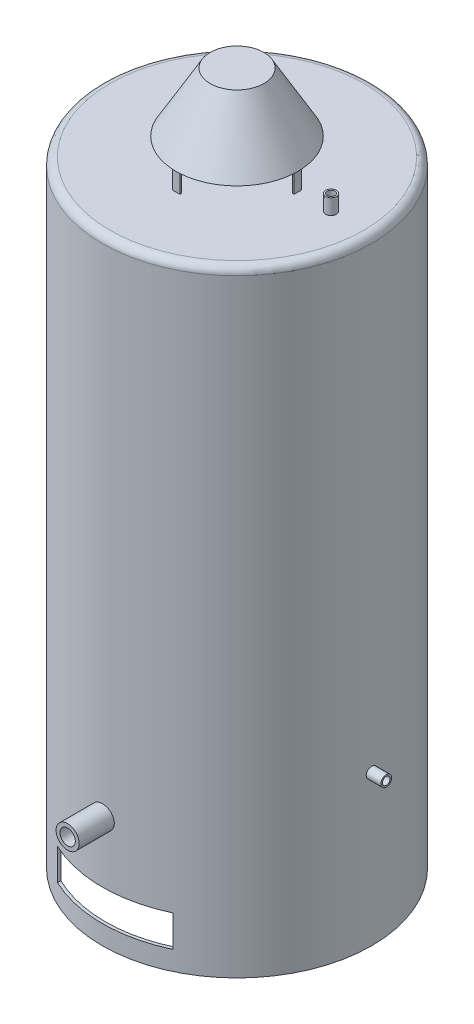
from build123d import *

# Parameters (mm, degrees)
SKETCH1_W               = 35
SKETCH1_H               = 4
SKETCH1_W_2             = 2.309401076
SKETCH1_H_2             = 23.341865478
SKETCH1_W_3             = 132
SKETCH1_H_3             = 700.940720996
SKETCH1_W_4             = 4
SKETCH1_H_4             = 20
CUT_EXTRUDE1_DEPTH      = 637.247074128
CUT_EXTRUDE1_DEPTH_BACK = 637.247074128
SKETCH2_W               = 50
SKETCH2_H               = 23.341865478
CUT_EXTRUDE2_DEPTH      = 637.247074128
CUT_EXTRUDE2_DEPTH_BACK = 637.247074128
SKETCH3_W               = 61.22677782
SKETCH3_H               = 23.341865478
SKETCH4_R               = 39
SKETCH4_R_2             = 35
BOSS_EXTRUDE1_DEPTH     = 20
FILLET3_R               = 10
FILLET4_R               = 10
CUT_EXTRUDE5_DEPTH      = 637.247074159
CUT_EXTRUDE5_DEPTH_BACK = 637.247074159
SKETCH5_W               = 75
SKETCH5_H               = 40.96262001
CUT_EXTRUDE6_REACH      = 638.247
CUT_EXTRUDE6_END_RADIUS = 175
SKETCH6_R               = 10
SKETCH7_R               = 7
SKETCH7_R_2             = 5
BOSS_EXTRUDE2_DEPTH     = 20
BOSS_EXTRUDE3_START     = 140
SKETCH8_R               = 7
SKETCH8_R_2             = 5
BOSS_EXTRUDE3_DEPTH     = 30
BOSS_EXTRUDE4_START     = 140
SKETCH9_R               = 15
SKETCH9_R_2             = 10
BOSS_EXTRUDE4_DEPTH     = 80
CUT_EXTRUDE8_REACH      = 855.111
SKETCH10_R              = 5
CUT_EXTRUDE10_START     = 110
SKETCH11_R              = 5
CUT_EXTRUDE10_DEPTH     = 541.065642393
CUT_EXTRUDE11_START     = 120
SKETCH12_R              = 10
CUT_EXTRUDE11_DEPTH     = 531.065642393


with BuildPart() as part:
    # Sketch1 → Revolve2 (revolve)
    with BuildSketch(Plane.XY, mode=Mode.PRIVATE) as revolve2_sk:
        with Locations((-6.37755102, 576.474769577)):
            Rectangle(SKETCH1_W, SKETCH1_H)
        Polygon((53.071642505, 501.816635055), (11.12244898, 574.474769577), (11.12244898, 578.474769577), (55.381043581, 501.816635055), align=None)
        with Locations((54.226343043, 490.145702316)):
            Rectangle(SKETCH1_W_2, SKETCH1_H_2)
        Polygon((147.12244898, -230.465951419), (147.12244898, -321.428571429), (151.12244898, -321.428571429), (151.12244898, 478.474769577), (11.12244898, 478.474769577), (11.12244898, -230.465951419), align=None)
        with Locations((81.12244898, 124.004409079)):
            Rectangle(SKETCH1_W_3, SKETCH1_H_3, mode=Mode.SUBTRACT)
        with Locations((13.12244898, 488.474769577)):
            Rectangle(SKETCH1_W_4, SKETCH1_H_4)
    revolve(revolve2_sk.sketch.rotate(Axis((-23.87755102, 578.474769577, 0), (0, -1, 0)), 180), axis=Axis((-23.87755102, 578.474769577, 0), (0, -1, 0)))

    # Sketch2 → Cut-Extrude1 (cut, two sides: drawn at the far end of the back side and taken through both)
    with BuildSketch(Plane.XY.offset(-CUT_EXTRUDE1_DEPTH_BACK)):
        with Locations((-53.87755102, 490.145702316)):
            Rectangle(SKETCH2_W, SKETCH2_H)
        with Locations((6.12244898, 490.145702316)):
            Rectangle(SKETCH2_W, SKETCH2_H)
    extrude(amount=CUT_EXTRUDE1_DEPTH + CUT_EXTRUDE1_DEPTH_BACK, mode=Mode.SUBTRACT)

    # Sketch3 → Cut-Extrude2 (cut, two sides: drawn at the far end of the back side and taken through both)
    with BuildSketch(Plane(origin=(0, 0, 0), x_dir=(0, 0, -1), z_dir=(1, 0, 0)).offset(-CUT_EXTRUDE2_DEPTH_BACK)):
        with Locations((-35.61338891, 490.145702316)):
            Rectangle(SKETCH3_W, SKETCH3_H)
        with Locations((35.61338891, 490.145702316)):
            Rectangle(SKETCH3_W, SKETCH3_H)
    extrude(amount=CUT_EXTRUDE2_DEPTH + CUT_EXTRUDE2_DEPTH_BACK, mode=Mode.SUBTRACT)

    # Sketch4 → Boss-Extrude1 (add)
    with BuildSketch(Plane(origin=(0, 478.474769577, 0), x_dir=(1, 0, 0), z_dir=(0, 1, 0))):
        with Locations(Location((-23.87755102, 0, 0), (0, 0, 180))):
            Circle(SKETCH4_R)
        with Locations(Location((-23.87755102, 0, 0), (0, 0, 180))):
            Circle(SKETCH4_R_2, mode=Mode.SUBTRACT)
    extrude(amount=BOSS_EXTRUDE1_DEPTH)

    # Fillet3
    fillet3_edges = [part.edges().sort_by_distance(p)[0] for p in [
        (151.12244898, 478.474769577, 0),
    ]]
    fillet(fillet3_edges, radius=FILLET3_R)

    # Fillet4
    fillet4_edges = [part.edges().sort_by_distance(p)[0] for p in [
        (147.12244898, 474.474769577, 0),
    ]]
    fillet(fillet4_edges, radius=FILLET4_R)

    # Sketch5 → Cut-Extrude5 (cut, two sides: drawn at the far end of the back side and taken through both)
    with BuildSketch(Plane.XY.offset(-CUT_EXTRUDE5_DEPTH_BACK)):
        with Locations((-61.37755102, -275.947261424)):
            Rectangle(SKETCH5_W, SKETCH5_H)
        with Locations((13.62244898, -275.947261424)):
            Rectangle(SKETCH5_W, SKETCH5_H)
    extrude(amount=CUT_EXTRUDE5_DEPTH + CUT_EXTRUDE5_DEPTH_BACK, mode=Mode.SUBTRACT)

    # Cut-Extrude6: up to this cylinder (the profile starts inside it)
    cut_extrude6_end = Plane(origin=(-23.87755102, -275.947261, 0), z_dir=(0, 1, 0)) * Cylinder(CUT_EXTRUDE6_END_RADIUS, 1627.494, mode=Mode.PRIVATE)
    # Sketch6 → Cut-Extrude6 (cut, up to the surface)
    with BuildSketch(Plane(origin=(0, 0, 0), x_dir=(0, 0, -1), z_dir=(1, 0, 0)), mode=Mode.PRIVATE) as cut_extrude6_sk1:
        with Locations((0, -275.947261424)):
            Circle(SKETCH6_R)
    cut_extrude6_tool1 = extrude(cut_extrude6_sk1.sketch, amount=-CUT_EXTRUDE6_REACH, mode=Mode.PRIVATE) & cut_extrude6_end
    add(cut_extrude6_tool1.solids().sort_by_distance((0, -275.947261, 0))[0], mode=Mode.SUBTRACT)

    # Sketch7 → Boss-Extrude2 (add)
    with BuildSketch(Plane(origin=(0, 478.474769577, 0), x_dir=(1, 0, 0), z_dir=(0, 1, 0))):
        with Locations(Location((98.251746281, 0, 0), (0, 0, 180))):
            Circle(SKETCH7_R)
        with Locations(Location((98.251746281, 0, 0), (0, 0, 180))):
            Circle(SKETCH7_R_2, mode=Mode.SUBTRACT)
    extrude(amount=BOSS_EXTRUDE2_DEPTH)

    # Sketch8 → Boss-Extrude3 (add)
    with BuildSketch(Plane(origin=(0, 0, 0), x_dir=(0, 0, -1), z_dir=(1, 0, 0)).offset(BOSS_EXTRUDE3_START)):
        with Locations(Location((0, -126.465951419, 0), (0, 0, 180))):
            Circle(SKETCH8_R)
        with Locations(Location((0, -126.465951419, 0), (0, 0, 180))):
            Circle(SKETCH8_R_2, mode=Mode.SUBTRACT)
    extrude(amount=BOSS_EXTRUDE3_DEPTH)

    # Sketch9 → Boss-Extrude4 (add)
    with BuildSketch(Plane.XY.offset(BOSS_EXTRUDE4_START)):
        with Locations(Location((-23.87755102, -176.465951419, 0), (0, 0, 180))):
            Circle(SKETCH9_R)
        with Locations(Location((-23.87755102, -176.465951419, 0), (0, 0, 180))):
            Circle(SKETCH9_R_2, mode=Mode.SUBTRACT)
    extrude(amount=BOSS_EXTRUDE4_DEPTH)

    # Sketch10 → Cut-Extrude8 (cut, up to next)
    with BuildSketch(Plane(origin=(0, 478.474769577, 0), x_dir=(1, 0, 0), z_dir=(0, 1, 0)), mode=Mode.PRIVATE) as cut_extrude8_sk1:
        with Locations(Location((98.251746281, 0, 0), (0, 0, 180))):
            Circle(SKETCH10_R)
    cut_extrude8_tool1 = extrude(cut_extrude8_sk1.sketch, amount=-CUT_EXTRUDE8_REACH, mode=Mode.PRIVATE) & part.part
    add(cut_extrude8_tool1.solids().sort_by_distance((98.251746, 478.47477, 0))[0], mode=Mode.SUBTRACT)

    # Sketch11 → Cut-Extrude10 (cut, through all)
    with BuildSketch(Plane(origin=(0, 0, 0), x_dir=(0, 0, -1), z_dir=(1, 0, 0)).offset(CUT_EXTRUDE10_START)):
        with Locations((0, -126.465951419)):
            Circle(SKETCH11_R)
    extrude(amount=CUT_EXTRUDE10_DEPTH, mode=Mode.SUBTRACT)

    # Sketch12 → Cut-Extrude11 (cut, through all)
    with BuildSketch(Plane.XY.offset(CUT_EXTRUDE11_START)):
        with Locations((-23.87755102, -176.465951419)):
            Circle(SKETCH12_R)
    extrude(amount=CUT_EXTRUDE11_DEPTH, mode=Mode.SUBTRACT)


solid = part.part
